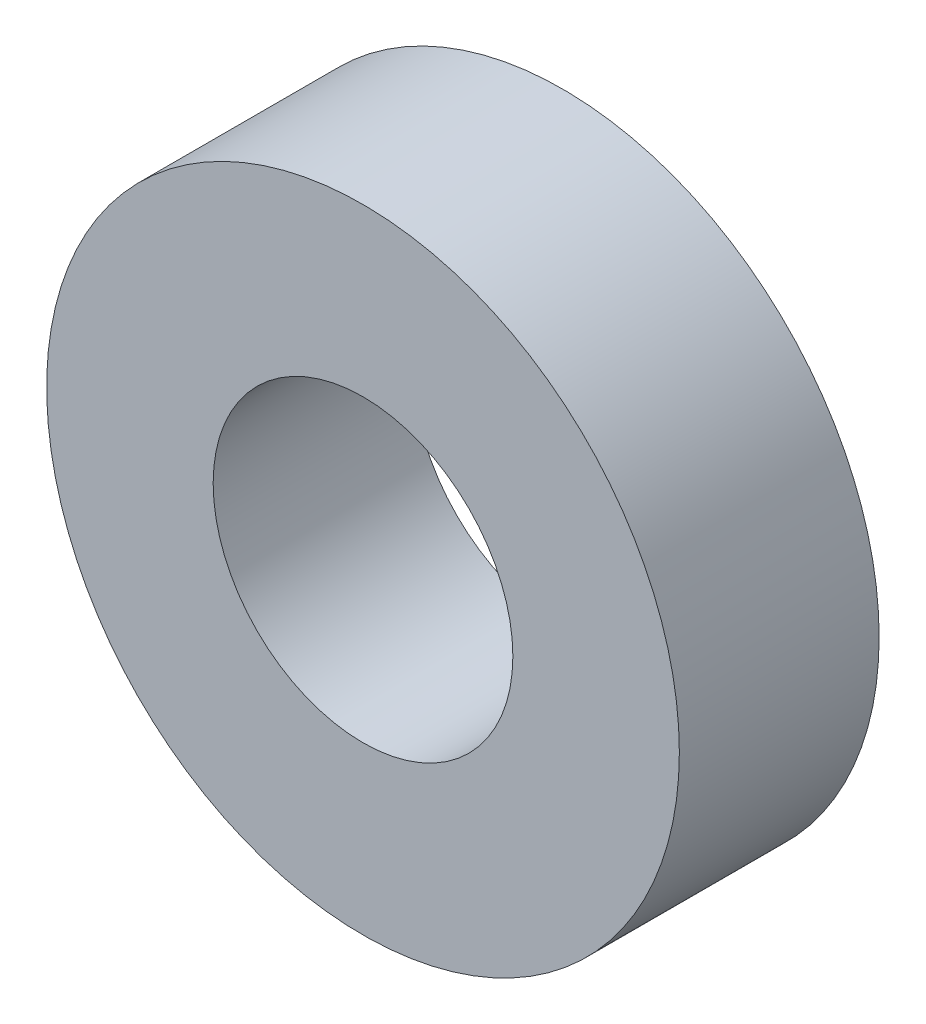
from build123d import *

# Parameters (mm, degrees)
SKETCH1_R           = 5.7
SKETCH1_R_2         = 2.7
BOSS_EXTRUDE1_DEPTH = 3.6


with BuildPart() as part:
    # Sketch1 → Boss-Extrude1 (new body)
    with BuildSketch(Plane.XY):
        Circle(SKETCH1_R)
        Circle(SKETCH1_R_2, mode=Mode.SUBTRACT)
    extrude(amount=BOSS_EXTRUDE1_DEPTH)


solid = part.part
